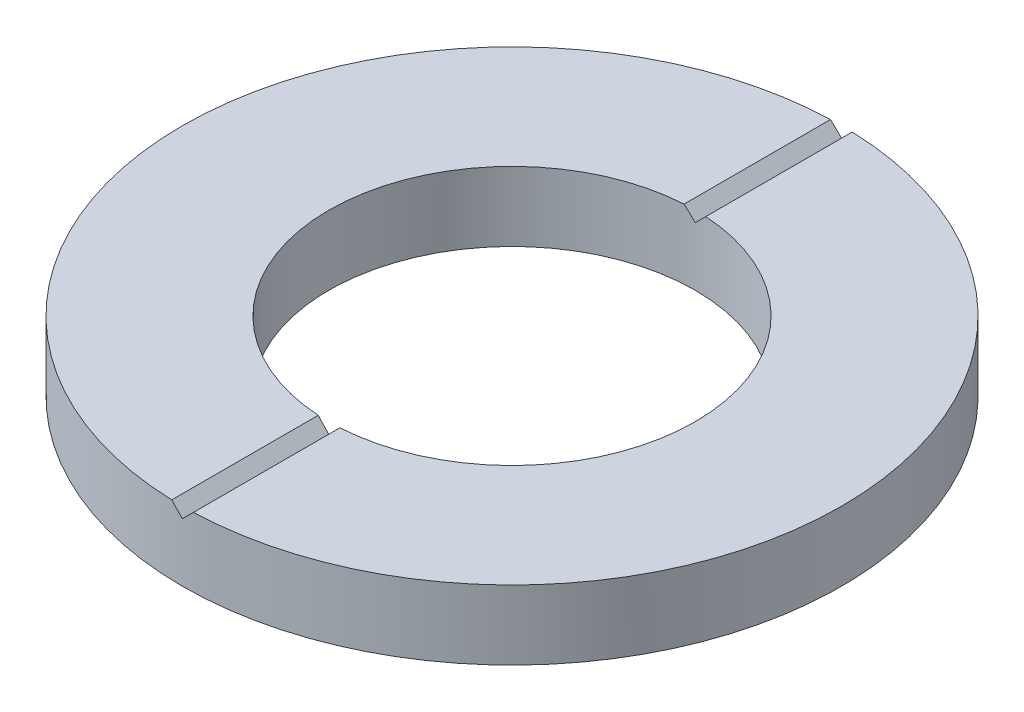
from build123d import *

# Parameters (mm, degrees)
SKETCH1_R           = 3.8608
SKETCH1_R_2         = 2.1463
BASE_EXTRUDE_DEPTH  = 0.8128
EXTRUDE1_DEPTH      = 6.52016278
EXTRUDE1_DEPTH_BACK = 6.52016278


with BuildPart() as part:
    # Sketch1 → Base-Extrude (new body)
    with BuildSketch(Plane(origin=(0, 0, 0), x_dir=(1, 0, 0), z_dir=(0, 1, 0))):
        with Locations(Location((0, 0, 0), (0, 0, 270))):
            Circle(SKETCH1_R)
        with Locations(Location((0, 0, 0), (0, 0, 270))):
            Circle(SKETCH1_R_2, mode=Mode.SUBTRACT)
    extrude(amount=BASE_EXTRUDE_DEPTH)

    # Sketch2 → Extrude1 (cut, two sides: drawn at the far end of the back side and taken through both)
    with BuildSketch(Plane.XY.offset(-EXTRUDE1_DEPTH_BACK)):
        Polygon((-0.127, 0.8128), (0, 0.6858), (0.127, 0.8128), align=None)
    extrude(amount=EXTRUDE1_DEPTH + EXTRUDE1_DEPTH_BACK, mode=Mode.SUBTRACT)


solid = part.part
